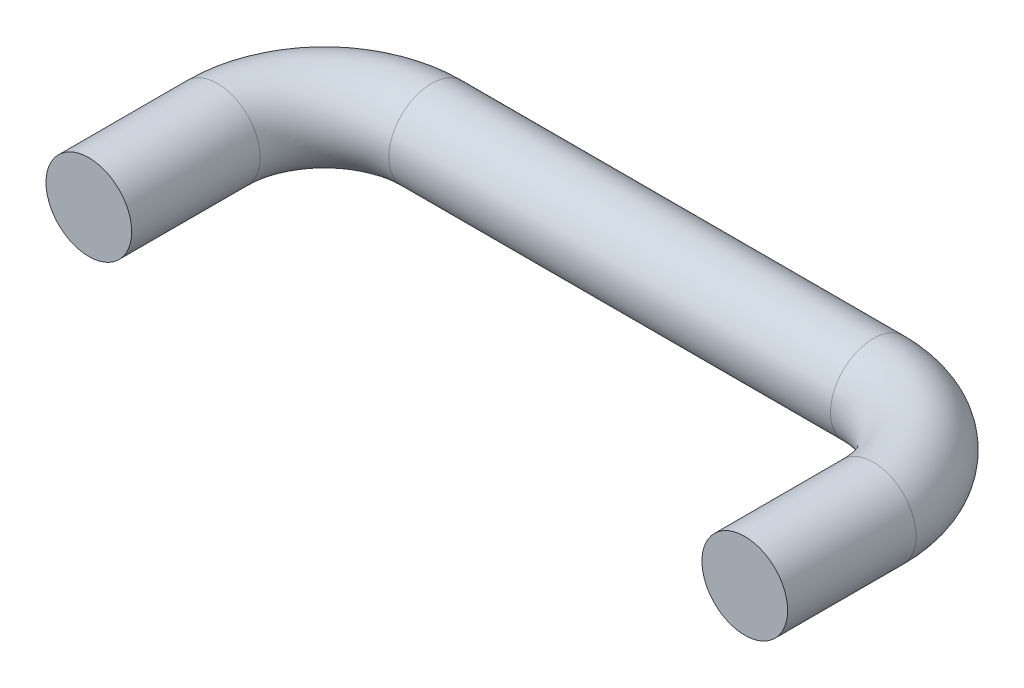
ISO-10303-21;
HEADER;
FILE_DESCRIPTION(('STEP AP214'),'2;1');
FILE_NAME('part.step','',(''),(''),'','','');
FILE_SCHEMA(('AUTOMOTIVE_DESIGN { 1 0 10303 214 1 1 1 1 }'));
ENDSEC;
DATA;
#1=APPLICATION_CONTEXT('core data for automotive mechanical design processes');
#2=APPLICATION_PROTOCOL_DEFINITION('international standard','automotive_design',2000,#1);
#3=PRODUCT_CONTEXT('',#1,'mechanical');
#4=PRODUCT('Part','Part','',(#3));
#5=PRODUCT_RELATED_PRODUCT_CATEGORY('part','',(#4));
#6=PRODUCT_DEFINITION_FORMATION('','',#4);
#7=PRODUCT_DEFINITION_CONTEXT('part definition',#1,'design');
#8=PRODUCT_DEFINITION('design','',#6,#7);
#9=PRODUCT_DEFINITION_SHAPE('','',#8);
#10=(LENGTH_UNIT() NAMED_UNIT(*) SI_UNIT(.MILLI.,.METRE.));
#11=(NAMED_UNIT(*) PLANE_ANGLE_UNIT() SI_UNIT($,.RADIAN.));
#12=(NAMED_UNIT(*) SI_UNIT($,.STERADIAN.) SOLID_ANGLE_UNIT());
#13=UNCERTAINTY_MEASURE_WITH_UNIT(LENGTH_MEASURE(1.E-05),#10,'distance_accuracy_value','');
#14=(GEOMETRIC_REPRESENTATION_CONTEXT(3) GLOBAL_UNCERTAINTY_ASSIGNED_CONTEXT((#13)) GLOBAL_UNIT_ASSIGNED_CONTEXT((#10,
#11,#12)) REPRESENTATION_CONTEXT('',''));
#15=CARTESIAN_POINT('',(0.,0.,0.));
#16=DIRECTION('',(0.,0.,1.));
#17=DIRECTION('',(1.,0.,0.));
#18=AXIS2_PLACEMENT_3D('',#15,#16,#17);
#19=CARTESIAN_POINT('',(3.8895,0.,1.524));
#20=DIRECTION('',(0.,0.,-1.));
#21=DIRECTION('',(-1.,0.,0.));
#22=AXIS2_PLACEMENT_3D('',#19,#20,#21);
#23=CYLINDRICAL_SURFACE('',#22,0.508000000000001);
#24=CARTESIAN_POINT('',(3.8895,0.,1.524));
#25=DIRECTION('',(0.,0.,1.));
#26=DIRECTION('',(1.,0.,0.));
#27=AXIS2_PLACEMENT_3D('',#24,#25,#26);
#28=CIRCLE('',#27,0.508000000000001);
#29=CARTESIAN_POINT('',(4.3975,0.,1.524));
#30=VERTEX_POINT('',#29);
#31=EDGE_CURVE('E10',#30,#30,#28,.T.);
#32=ORIENTED_EDGE('',*,*,#31,.F.);
#33=EDGE_LOOP('',(#32));
#34=FACE_BOUND('',#33,.T.);
#35=CARTESIAN_POINT('',(3.8895,0.,0.));
#36=DIRECTION('',(0.,0.,-1.));
#37=DIRECTION('',(-1.,0.,0.));
#38=AXIS2_PLACEMENT_3D('',#35,#36,#37);
#39=CIRCLE('',#38,0.508000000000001);
#40=CARTESIAN_POINT('',(4.3975,0.,0.));
#41=VERTEX_POINT('',#40);
#42=EDGE_CURVE('E43',#41,#41,#39,.T.);
#43=ORIENTED_EDGE('',*,*,#42,.F.);
#44=EDGE_LOOP('',(#43));
#45=FACE_BOUND('',#44,.T.);
#46=ADVANCED_FACE('F33',(#34,#45),#23,.T.);
#47=CARTESIAN_POINT('',(3.8895,0.,1.524));
#48=DIRECTION('',(0.,0.,1.));
#49=DIRECTION('',(1.,0.,0.));
#50=AXIS2_PLACEMENT_3D('',#47,#48,#49);
#51=PLANE('',#50);
#52=ORIENTED_EDGE('',*,*,#31,.T.);
#53=EDGE_LOOP('',(#52));
#54=FACE_BOUND('',#53,.T.);
#55=ADVANCED_FACE('F79',(#54),#51,.T.);
#56=CARTESIAN_POINT('',(2.6195,0.,0.));
#57=DIRECTION('',(0.,-1.,0.));
#58=DIRECTION('',(1.,0.,0.));
#59=AXIS2_PLACEMENT_3D('',#56,#57,#58);
#60=TOROIDAL_SURFACE('',#59,1.27,0.508000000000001);
#61=CARTESIAN_POINT('',(2.6195,0.,-1.27));
#62=DIRECTION('',(-1.,0.,0.));
#63=DIRECTION('',(0.,0.,1.));
#64=AXIS2_PLACEMENT_3D('',#61,#62,#63);
#65=CIRCLE('',#64,0.508000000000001);
#66=CARTESIAN_POINT('',(2.61949999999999,0.,-1.778));
#67=VERTEX_POINT('',#66);
#68=EDGE_CURVE('E39',#67,#67,#65,.T.);
#69=CARTESIAN_POINT('',(2.6195,0.,0.));
#70=DIRECTION('',(0.,-1.,0.));
#71=DIRECTION('',(1.,0.,0.));
#72=AXIS2_PLACEMENT_3D('',#69,#70,#71);
#73=CIRCLE('',#72,1.778);
#74=EDGE_CURVE('',#67,#41,#73,.T.);
#75=ORIENTED_EDGE('',*,*,#68,.F.);
#76=ORIENTED_EDGE('',*,*,#42,.T.);
#77=ORIENTED_EDGE('',*,*,#74,.T.);
#78=ORIENTED_EDGE('',*,*,#74,.F.);
#79=EDGE_LOOP('',(#75,#77,#76,#78));
#80=FACE_BOUND('',#79,.T.);
#81=ADVANCED_FACE('F74',(#80),#60,.T.);
#82=CARTESIAN_POINT('',(-500000.,8.74269121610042E-11,-1.26999999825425));
#83=DIRECTION('',(1.,0.,0.));
#84=DIRECTION('',(0.,0.,-1.));
#85=AXIS2_PLACEMENT_3D('',#82,#83,#84);
#86=CYLINDRICAL_SURFACE('',#85,0.507999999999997);
#87=CARTESIAN_POINT('',(-2.61949999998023,0.,-1.26999999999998));
#88=DIRECTION('',(1.,0.,0.));
#89=DIRECTION('',(0.,0.,-1.));
#90=AXIS2_PLACEMENT_3D('',#87,#88,#89);
#91=CIRCLE('',#90,0.507999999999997);
#92=CARTESIAN_POINT('',(-2.61949999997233,0.,-1.778));
#93=VERTEX_POINT('',#92);
#94=EDGE_CURVE('E47',#93,#93,#91,.T.);
#95=ORIENTED_EDGE('',*,*,#94,.T.);
#96=EDGE_LOOP('',(#95));
#97=FACE_BOUND('',#96,.T.);
#98=ORIENTED_EDGE('',*,*,#68,.T.);
#99=EDGE_LOOP('',(#98));
#100=FACE_BOUND('',#99,.T.);
#101=ADVANCED_FACE('F65',(#97,#100),#86,.T.);
#102=CARTESIAN_POINT('',(-3.8895,0.,1.524));
#103=DIRECTION('',(0.,0.,-1.));
#104=DIRECTION('',(-1.,0.,0.));
#105=AXIS2_PLACEMENT_3D('',#102,#103,#104);
#106=CYLINDRICAL_SURFACE('',#105,0.508000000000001);
#107=CARTESIAN_POINT('',(-3.8895,0.,1.524));
#108=DIRECTION('',(0.,0.,1.));
#109=DIRECTION('',(1.,0.,0.));
#110=AXIS2_PLACEMENT_3D('',#107,#108,#109);
#111=CIRCLE('',#110,0.508000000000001);
#112=CARTESIAN_POINT('',(-3.3815,0.,1.524));
#113=VERTEX_POINT('',#112);
#114=EDGE_CURVE('E52',#113,#113,#111,.T.);
#115=ORIENTED_EDGE('',*,*,#114,.F.);
#116=EDGE_LOOP('',(#115));
#117=FACE_BOUND('',#116,.T.);
#118=CARTESIAN_POINT('',(-3.8895,0.,0.));
#119=DIRECTION('',(0.,0.,-1.));
#120=DIRECTION('',(-1.,0.,0.));
#121=AXIS2_PLACEMENT_3D('',#118,#119,#120);
#122=CIRCLE('',#121,0.508000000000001);
#123=CARTESIAN_POINT('',(-4.3975,0.,0.));
#124=VERTEX_POINT('',#123);
#125=EDGE_CURVE('E56',#124,#124,#122,.T.);
#126=ORIENTED_EDGE('',*,*,#125,.F.);
#127=EDGE_LOOP('',(#126));
#128=FACE_BOUND('',#127,.T.);
#129=ADVANCED_FACE('F62',(#117,#128),#106,.T.);
#130=CARTESIAN_POINT('',(-3.8895,0.,1.524));
#131=DIRECTION('',(0.,0.,1.));
#132=DIRECTION('',(1.,0.,0.));
#133=AXIS2_PLACEMENT_3D('',#130,#131,#132);
#134=PLANE('',#133);
#135=ORIENTED_EDGE('',*,*,#114,.T.);
#136=EDGE_LOOP('',(#135));
#137=FACE_BOUND('',#136,.T.);
#138=ADVANCED_FACE('F64',(#137),#134,.T.);
#139=CARTESIAN_POINT('',(-2.6195,0.,0.));
#140=DIRECTION('',(0.,1.,0.));
#141=DIRECTION('',(-1.,0.,0.));
#142=AXIS2_PLACEMENT_3D('',#139,#140,#141);
#143=TOROIDAL_SURFACE('',#142,1.27,0.508000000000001);
#144=CARTESIAN_POINT('',(-2.6195,0.,0.));
#145=DIRECTION('',(0.,1.,0.));
#146=DIRECTION('',(-1.,0.,0.));
#147=AXIS2_PLACEMENT_3D('',#144,#145,#146);
#148=CIRCLE('',#147,1.778);
#149=EDGE_CURVE('',#93,#124,#148,.T.);
#150=ORIENTED_EDGE('',*,*,#94,.F.);
#151=ORIENTED_EDGE('',*,*,#125,.T.);
#152=ORIENTED_EDGE('',*,*,#149,.T.);
#153=ORIENTED_EDGE('',*,*,#149,.F.);
#154=EDGE_LOOP('',(#150,#152,#151,#153));
#155=FACE_BOUND('',#154,.T.);
#156=ADVANCED_FACE('F60',(#155),#143,.T.);
#157=CLOSED_SHELL('',(#46,#55,#81,#101,#129,#138,#156));
#158=MANIFOLD_SOLID_BREP('B2',#157);
#159=ADVANCED_BREP_SHAPE_REPRESENTATION('',(#18,#158),#14);
#160=SHAPE_DEFINITION_REPRESENTATION(#9,#159);
ENDSEC;
END-ISO-10303-21;
